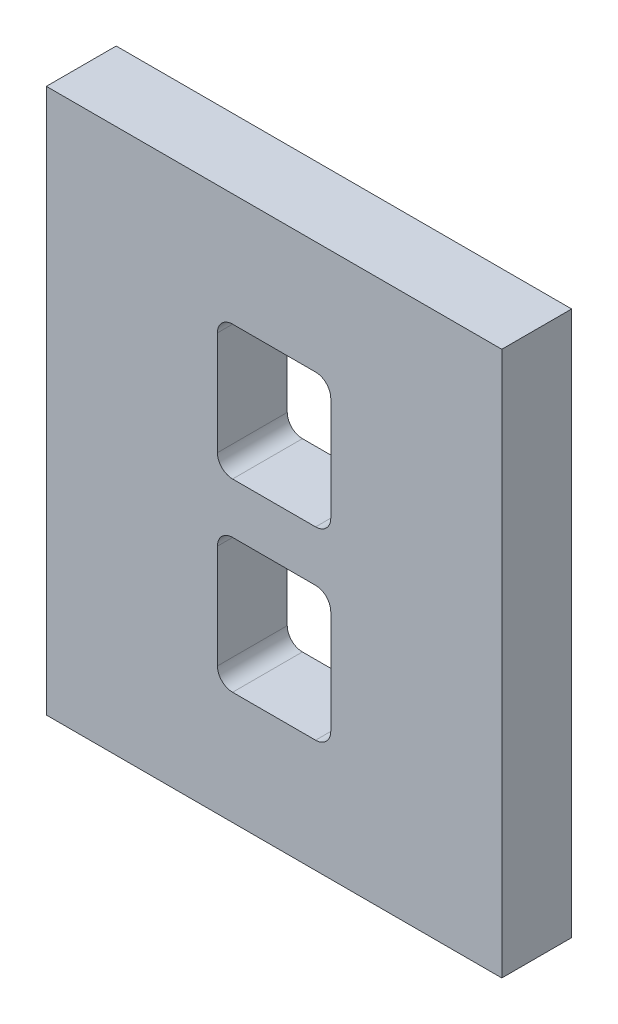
from build123d import *

# Parameters (mm, degrees)
SKETCH1_W           = 57.15
SKETCH1_H           = 68.326
BOSS_EXTRUDE1_DEPTH = 8.763
CUT_EXTRUDE1_DEPTH  = 90.506172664


with BuildPart() as part:
    # Sketch1 → Boss-Extrude1 (new body)
    with BuildSketch(Plane.XY):
        with Locations((28.575, 34.163)):
            Rectangle(SKETCH1_W, SKETCH1_H)
    extrude(amount=BOSS_EXTRUDE1_DEPTH)

    # Sketch2 → Cut-Extrude1 (cut, through all)
    with BuildSketch(Plane.XY.offset(8.763)):
        with BuildLine():
            Line((23.368, 14.1605), (33.782, 14.1605))
            ThreePointArc((33.782, 14.1605), (35.129038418, 14.718461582), (35.687, 16.0655))
            Line((35.687, 16.0655), (35.687, 29.083))
            ThreePointArc((35.687, 29.083), (35.129038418, 30.430038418), (33.782, 30.988))
            Line((33.782, 30.988), (23.368, 30.988))
            ThreePointArc((23.368, 30.988), (22.020961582, 30.430038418), (21.463, 29.083))
            Line((21.463, 29.083), (21.463, 16.0655))
            ThreePointArc((21.463, 16.0655), (22.020961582, 14.718461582), (23.368, 14.1605))
        make_face()
        with BuildLine():
            Line((35.687, 52.2605), (35.687, 39.243))
            ThreePointArc((35.687, 39.243), (35.129038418, 37.895961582), (33.782, 37.338))
            Line((33.782, 37.338), (23.368, 37.338))
            ThreePointArc((23.368, 37.338), (22.020961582, 37.895961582), (21.463, 39.243))
            Line((21.463, 39.243), (21.463, 52.2605))
            ThreePointArc((21.463, 52.2605), (22.020961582, 53.607538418), (23.368, 54.1655))
            Line((23.368, 54.1655), (33.782, 54.1655))
            ThreePointArc((33.782, 54.1655), (35.129038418, 53.607538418), (35.687, 52.2605))
        make_face()
    extrude(amount=-CUT_EXTRUDE1_DEPTH, mode=Mode.SUBTRACT)


solid = part.part
